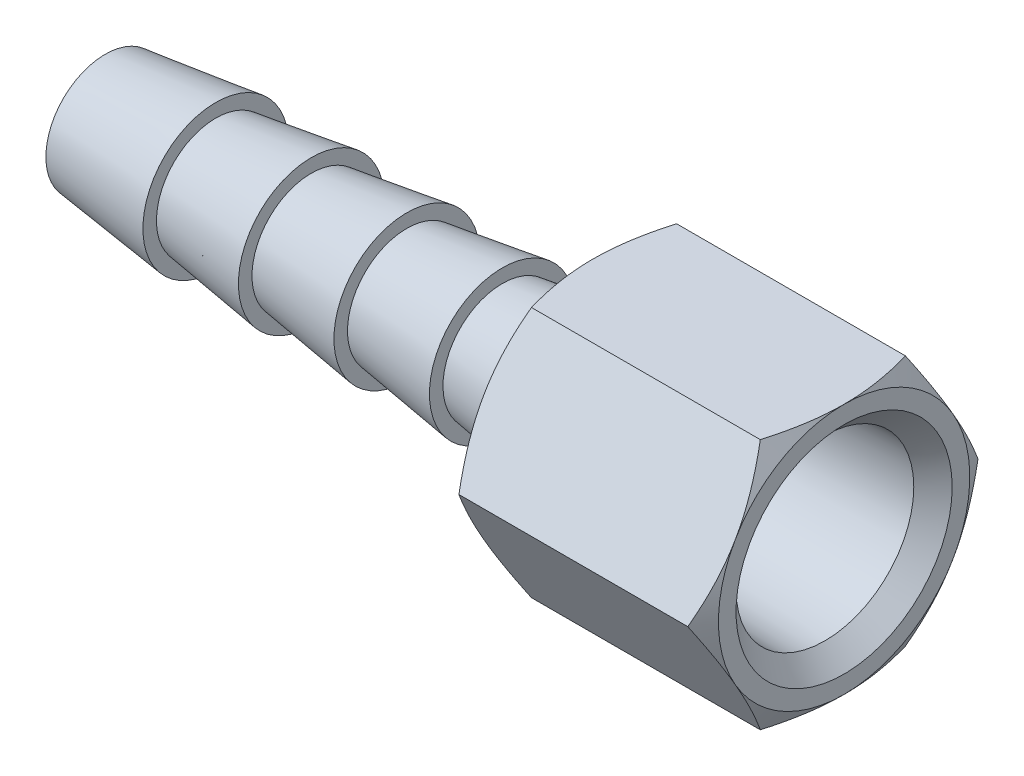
ISO-10303-21;
HEADER;
FILE_DESCRIPTION(('STEP AP214'),'2;1');
FILE_NAME('part.step','',(''),(''),'','','');
FILE_SCHEMA(('AUTOMOTIVE_DESIGN { 1 0 10303 214 1 1 1 1 }'));
ENDSEC;
DATA;
#1=APPLICATION_CONTEXT('core data for automotive mechanical design processes');
#2=APPLICATION_PROTOCOL_DEFINITION('international standard','automotive_design',2000,#1);
#3=PRODUCT_CONTEXT('',#1,'mechanical');
#4=PRODUCT('Part','Part','',(#3));
#5=PRODUCT_RELATED_PRODUCT_CATEGORY('part','',(#4));
#6=PRODUCT_DEFINITION_FORMATION('','',#4);
#7=PRODUCT_DEFINITION_CONTEXT('part definition',#1,'design');
#8=PRODUCT_DEFINITION('design','',#6,#7);
#9=PRODUCT_DEFINITION_SHAPE('','',#8);
#10=(LENGTH_UNIT() NAMED_UNIT(*) SI_UNIT(.MILLI.,.METRE.));
#11=(NAMED_UNIT(*) PLANE_ANGLE_UNIT() SI_UNIT($,.RADIAN.));
#12=(NAMED_UNIT(*) SI_UNIT($,.STERADIAN.) SOLID_ANGLE_UNIT());
#13=UNCERTAINTY_MEASURE_WITH_UNIT(LENGTH_MEASURE(1.E-05),#10,'distance_accuracy_value','');
#14=(GEOMETRIC_REPRESENTATION_CONTEXT(3) GLOBAL_UNCERTAINTY_ASSIGNED_CONTEXT((#13)) GLOBAL_UNIT_ASSIGNED_CONTEXT((#10,
#11,#12)) REPRESENTATION_CONTEXT('',''));
#15=CARTESIAN_POINT('',(0.,0.,0.));
#16=DIRECTION('',(0.,0.,1.));
#17=DIRECTION('',(1.,0.,0.));
#18=AXIS2_PLACEMENT_3D('',#15,#16,#17);
#19=CARTESIAN_POINT('',(24.6379999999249,0.,0.));
#20=DIRECTION('',(1.,0.,0.));
#21=DIRECTION('',(0.,1.,0.));
#22=AXIS2_PLACEMENT_3D('',#19,#20,#21);
#23=CONICAL_SURFACE('',#22,3.68299999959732,0.148889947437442);
#24=CARTESIAN_POINT('',(24.6380000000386,0.,0.));
#25=DIRECTION('',(1.,0.,0.));
#26=DIRECTION('',(0.,1.,0.));
#27=AXIS2_PLACEMENT_3D('',#24,#25,#26);
#28=CIRCLE('',#27,3.68299999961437);
#29=CARTESIAN_POINT('',(24.6380000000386,3.68299999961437,0.));
#30=VERTEX_POINT('',#29);
#31=EDGE_CURVE('E466',#30,#30,#28,.F.);
#32=ORIENTED_EDGE('',*,*,#31,.T.);
#33=EDGE_LOOP('',(#32));
#34=FACE_BOUND('',#33,.T.);
#35=CARTESIAN_POINT('',(20.0659999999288,0.,0.));
#36=DIRECTION('',(1.,0.,0.));
#37=DIRECTION('',(0.,1.,0.));
#38=AXIS2_PLACEMENT_3D('',#35,#36,#37);
#39=CIRCLE('',#38,2.99720000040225);
#40=CARTESIAN_POINT('',(20.0659999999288,2.99720000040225,0.));
#41=VERTEX_POINT('',#40);
#42=EDGE_CURVE('E20',#41,#41,#39,.F.);
#43=ORIENTED_EDGE('',*,*,#42,.F.);
#44=EDGE_LOOP('',(#43));
#45=FACE_BOUND('',#44,.T.);
#46=ADVANCED_FACE('F16',(#34,#45),#23,.T.);
#47=CARTESIAN_POINT('',(20.066,0.,1.8415));
#48=DIRECTION('',(1.,0.,0.));
#49=DIRECTION('',(0.,0.,-1.));
#50=AXIS2_PLACEMENT_3D('',#47,#48,#49);
#51=PLANE('',#50);
#52=ORIENTED_EDGE('',*,*,#42,.T.);
#53=EDGE_LOOP('',(#52));
#54=FACE_BOUND('',#53,.T.);
#55=CARTESIAN_POINT('',(20.0660000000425,0.,0.));
#56=DIRECTION('',(1.,0.,0.));
#57=DIRECTION('',(0.,0.,-1.));
#58=AXIS2_PLACEMENT_3D('',#55,#56,#57);
#59=CIRCLE('',#58,3.68299999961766);
#60=CARTESIAN_POINT('',(20.0660000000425,0.,-3.68299999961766));
#61=VERTEX_POINT('',#60);
#62=EDGE_CURVE('E133',#61,#61,#59,.F.);
#63=ORIENTED_EDGE('',*,*,#62,.F.);
#64=EDGE_LOOP('',(#63));
#65=FACE_BOUND('',#64,.T.);
#66=ADVANCED_FACE('F172',(#54,#65),#51,.T.);
#67=CARTESIAN_POINT('',(24.638,0.,0.));
#68=DIRECTION('',(1.,0.,0.));
#69=DIRECTION('',(0.,0.,-1.));
#70=AXIS2_PLACEMENT_3D('',#67,#68,#69);
#71=PLANE('',#70);
#72=ORIENTED_EDGE('',*,*,#31,.F.);
#73=EDGE_LOOP('',(#72));
#74=FACE_BOUND('',#73,.T.);
#75=CARTESIAN_POINT('',(24.6379999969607,0.,0.));
#76=DIRECTION('',(1.,0.,0.));
#77=DIRECTION('',(0.,0.,-1.));
#78=AXIS2_PLACEMENT_3D('',#75,#76,#77);
#79=CIRCLE('',#78,6.35000000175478);
#80=CARTESIAN_POINT('',(24.6379999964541,3.17500000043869,5.49926131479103));
#81=VERTEX_POINT('',#80);
#82=CARTESIAN_POINT('',(24.6379999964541,-3.1750000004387,5.49926131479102));
#83=VERTEX_POINT('',#82);
#84=EDGE_CURVE('E125',#81,#83,#79,.T.);
#85=ORIENTED_EDGE('',*,*,#84,.F.);
#86=CARTESIAN_POINT('',(24.6379999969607,0.,0.));
#87=DIRECTION('',(1.,0.,0.));
#88=DIRECTION('',(0.,0.,-1.));
#89=AXIS2_PLACEMENT_3D('',#86,#87,#88);
#90=CIRCLE('',#89,6.35000000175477);
#91=CARTESIAN_POINT('',(24.6379999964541,6.35000000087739,0.));
#92=VERTEX_POINT('',#91);
#93=EDGE_CURVE('E103',#92,#81,#90,.T.);
#94=ORIENTED_EDGE('',*,*,#93,.F.);
#95=CARTESIAN_POINT('',(24.6379999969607,0.,0.));
#96=DIRECTION('',(1.,0.,0.));
#97=DIRECTION('',(0.,0.,-1.));
#98=AXIS2_PLACEMENT_3D('',#95,#96,#97);
#99=CIRCLE('',#98,6.35000000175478);
#100=CARTESIAN_POINT('',(24.6379999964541,3.17500000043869,-5.49926131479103));
#101=VERTEX_POINT('',#100);
#102=EDGE_CURVE('E113',#101,#92,#99,.T.);
#103=ORIENTED_EDGE('',*,*,#102,.F.);
#104=CARTESIAN_POINT('',(24.6379999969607,0.,0.));
#105=DIRECTION('',(1.,0.,0.));
#106=DIRECTION('',(0.,0.,-1.));
#107=AXIS2_PLACEMENT_3D('',#104,#105,#106);
#108=CIRCLE('',#107,6.35000000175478);
#109=CARTESIAN_POINT('',(24.6379999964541,-3.17500000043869,-5.49926131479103));
#110=VERTEX_POINT('',#109);
#111=EDGE_CURVE('E461',#110,#101,#108,.T.);
#112=ORIENTED_EDGE('',*,*,#111,.F.);
#113=CARTESIAN_POINT('',(24.6379999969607,0.,0.));
#114=DIRECTION('',(1.,0.,0.));
#115=DIRECTION('',(0.,0.,-1.));
#116=AXIS2_PLACEMENT_3D('',#113,#114,#115);
#117=CIRCLE('',#116,6.35000000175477);
#118=CARTESIAN_POINT('',(24.6379999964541,-6.35000000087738,0.));
#119=VERTEX_POINT('',#118);
#120=EDGE_CURVE('E440',#119,#110,#117,.T.);
#121=ORIENTED_EDGE('',*,*,#120,.F.);
#122=CARTESIAN_POINT('',(24.6379999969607,0.,0.));
#123=DIRECTION('',(1.,0.,0.));
#124=DIRECTION('',(0.,0.,-1.));
#125=AXIS2_PLACEMENT_3D('',#122,#123,#124);
#126=CIRCLE('',#125,6.35000000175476);
#127=EDGE_CURVE('E128',#83,#119,#126,.T.);
#128=ORIENTED_EDGE('',*,*,#127,.F.);
#129=EDGE_LOOP('',(#85,#94,#103,#112,#121,#128));
#130=FACE_BOUND('',#129,.T.);
#131=ADVANCED_FACE('F126',(#74,#130),#71,.F.);
#132=CARTESIAN_POINT('',(20.0660000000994,0.,0.));
#133=DIRECTION('',(1.,0.,0.));
#134=DIRECTION('',(0.,0.,-1.));
#135=AXIS2_PLACEMENT_3D('',#132,#133,#134);
#136=CONICAL_SURFACE('',#135,3.68299999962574,0.141160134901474);
#137=CARTESIAN_POINT('',(15.2399999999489,0.,0.));
#138=DIRECTION('',(1.,0.,0.));
#139=DIRECTION('',(0.,0.,-1.));
#140=AXIS2_PLACEMENT_3D('',#137,#138,#139);
#141=CIRCLE('',#140,2.99720000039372);
#142=CARTESIAN_POINT('',(15.2399999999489,0.,-2.99720000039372));
#143=VERTEX_POINT('',#142);
#144=EDGE_CURVE('E112',#143,#143,#141,.F.);
#145=ORIENTED_EDGE('',*,*,#144,.F.);
#146=EDGE_LOOP('',(#145));
#147=FACE_BOUND('',#146,.T.);
#148=ORIENTED_EDGE('',*,*,#62,.T.);
#149=EDGE_LOOP('',(#148));
#150=FACE_BOUND('',#149,.T.);
#151=ADVANCED_FACE('F163',(#147,#150),#136,.T.);
#152=CARTESIAN_POINT('',(25.2085620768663,0.,0.));
#153=DIRECTION('',(1.,0.,0.));
#154=DIRECTION('',(0.,0.,-1.));
#155=AXIS2_PLACEMENT_3D('',#152,#153,#154);
#156=CONICAL_SURFACE('',#155,7.33824251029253,1.04719755);
#157=ORIENTED_EDGE('',*,*,#84,.T.);
#158=CARTESIAN_POINT('',(25.2051591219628,7.33747232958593E-10,7.33234841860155));
#159=CARTESIAN_POINT('',(25.1189896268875,-0.258443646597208,7.18313590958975));
#160=CARTESIAN_POINT('',(25.0400433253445,-0.518957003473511,7.03272845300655));
#161=CARTESIAN_POINT('',(24.9008229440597,-1.0422801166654,6.73058771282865));
#162=CARTESIAN_POINT('',(24.8404565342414,-1.30507161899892,6.5788649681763));
#163=CARTESIAN_POINT('',(24.7663368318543,-1.70173898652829,6.34984895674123));
#164=CARTESIAN_POINT('',(24.744359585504,-1.83446251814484,6.27322099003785));
#165=CARTESIAN_POINT('',(24.7063165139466,-2.10054498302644,6.1195982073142));
#166=CARTESIAN_POINT('',(24.6902505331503,-2.23390389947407,6.04260340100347));
#167=CARTESIAN_POINT('',(24.6643122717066,-2.50175041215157,5.88796214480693));
#168=CARTESIAN_POINT('',(24.6544714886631,-2.636240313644,5.81031436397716));
#169=CARTESIAN_POINT('',(24.6413017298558,-2.90548461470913,5.65486609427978));
#170=CARTESIAN_POINT('',(24.6379740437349,-3.04023906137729,5.57706557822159));
#171=CARTESIAN_POINT('',(24.6379999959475,-3.17499999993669,5.49926131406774));
#172=B_SPLINE_CURVE_WITH_KNOTS('',3,(#158,#159,#160,#161,#162,#163,#164,#165,#166,#167,#168,
#169,#170,#171),.UNSPECIFIED.,.F.,.F.,(4,2,2,2,2,2,4),(0.,0.932226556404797,1.85974282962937,
2.32410951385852,2.78846397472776,3.25514952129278,3.72192746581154),.UNSPECIFIED.);
#173=CARTESIAN_POINT('',(25.2051591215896,-2.86750911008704E-10,7.3323484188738));
#174=VERTEX_POINT('',#173);
#175=EDGE_CURVE('E136',#174,#83,#172,.T.);
#176=ORIENTED_EDGE('',*,*,#175,.F.);
#177=CARTESIAN_POINT('',(24.6379999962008,3.17499999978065,5.49926131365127));
#178=CARTESIAN_POINT('',(24.637974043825,3.04023906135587,5.57706557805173));
#179=CARTESIAN_POINT('',(24.6413017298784,2.90548461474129,5.65486609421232));
#180=CARTESIAN_POINT('',(24.6544714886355,2.63624031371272,5.81031436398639));
#181=CARTESIAN_POINT('',(24.6643122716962,2.50175041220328,5.88796214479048));
#182=CARTESIAN_POINT('',(24.6902505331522,2.23390389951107,6.04260340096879));
#183=CARTESIAN_POINT('',(24.7063165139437,2.10054498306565,6.11959820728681));
#184=CARTESIAN_POINT('',(24.7443595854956,1.83446251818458,6.27322099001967));
#185=CARTESIAN_POINT('',(24.766336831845,1.70173898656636,6.34984895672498));
#186=CARTESIAN_POINT('',(24.840456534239,1.30507161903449,6.57886496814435));
#187=CARTESIAN_POINT('',(24.9008229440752,1.0422801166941,6.73058771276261));
#188=CARTESIAN_POINT('',(25.0400433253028,0.518957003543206,7.03272845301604));
#189=CARTESIAN_POINT('',(25.1189896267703,0.258443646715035,7.18313590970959));
#190=CARTESIAN_POINT('',(25.2051591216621,-5.04110904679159E-10,7.3323484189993));
#191=B_SPLINE_CURVE_WITH_KNOTS('',3,(#177,#178,#179,#180,#181,#182,#183,#184,#185,#186,#187,
#188,#189,#190),.UNSPECIFIED.,.F.,.F.,(4,2,2,2,2,2,4),(0.,0.466777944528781,0.933463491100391,
1.39781795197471,1.86218463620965,2.78970090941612,3.7219274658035),.UNSPECIFIED.);
#192=EDGE_CURVE('E118',#81,#174,#191,.T.);
#193=ORIENTED_EDGE('',*,*,#192,.F.);
#194=EDGE_LOOP('',(#157,#176,#193));
#195=FACE_BOUND('',#194,.T.);
#196=ADVANCED_FACE('F135',(#195),#156,.T.);
#197=CARTESIAN_POINT('',(25.2085620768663,0.,0.));
#198=DIRECTION('',(1.,0.,0.));
#199=DIRECTION('',(0.,0.,-1.));
#200=AXIS2_PLACEMENT_3D('',#197,#198,#199);
#201=CONICAL_SURFACE('',#200,7.33824251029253,1.04719755);
#202=ORIENTED_EDGE('',*,*,#127,.T.);
#203=CARTESIAN_POINT('',(25.2051591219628,-6.34999999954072,3.66617420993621));
#204=CARTESIAN_POINT('',(25.1189896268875,-6.34999999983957,3.367749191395));
#205=CARTESIAN_POINT('',(25.0400433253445,-6.34999999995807,3.06693427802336));
#206=CARTESIAN_POINT('',(24.9008229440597,-6.35000000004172,2.46265279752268));
#207=CARTESIAN_POINT('',(24.8404565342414,-6.35000000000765,2.15920730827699));
#208=CARTESIAN_POINT('',(24.7663368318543,-6.34999999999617,1.70117528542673));
#209=CARTESIAN_POINT('',(24.744359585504,-6.34999999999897,1.54791935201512));
#210=CARTESIAN_POINT('',(24.7063165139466,-6.35000000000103,1.24067378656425));
#211=CARTESIAN_POINT('',(24.6902505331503,-6.35000000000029,1.08668417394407));
#212=CARTESIAN_POINT('',(24.6643122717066,-6.3499999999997,0.777401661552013));
#213=CARTESIAN_POINT('',(24.6544714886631,-6.34999999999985,0.62210609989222));
#214=CARTESIAN_POINT('',(24.6413017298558,-6.35000000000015,0.311209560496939));
#215=CARTESIAN_POINT('',(24.6379740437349,-6.3500000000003,0.1556085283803));
#216=CARTESIAN_POINT('',(24.6379999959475,-6.35,7.31096608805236E-11));
#217=B_SPLINE_CURVE_WITH_KNOTS('',3,(#203,#204,#205,#206,#207,#208,#209,#210,#211,#212,#213,
#214,#215,#216),.UNSPECIFIED.,.F.,.F.,(4,2,2,2,2,2,4),(0.,0.932226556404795,1.85974282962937,
2.32410951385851,2.78846397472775,3.25514952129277,3.72192746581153),.UNSPECIFIED.);
#218=CARTESIAN_POINT('',(25.2051591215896,-6.35000000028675,3.66617420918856));
#219=VERTEX_POINT('',#218);
#220=EDGE_CURVE('E236',#219,#119,#217,.T.);
#221=ORIENTED_EDGE('',*,*,#220,.F.);
#222=CARTESIAN_POINT('',(24.6379999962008,-3.17499999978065,5.49926131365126));
#223=CARTESIAN_POINT('',(24.637974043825,-3.30976093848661,5.4214570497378));
#224=CARTESIAN_POINT('',(24.6413017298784,-3.44451538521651,5.34365653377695));
#225=CARTESIAN_POINT('',(24.6544714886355,-3.71375968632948,5.18820826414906));
#226=CARTESIAN_POINT('',(24.6643122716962,-3.84824958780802,5.11056048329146));
#227=CARTESIAN_POINT('',(24.6902505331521,-4.11609610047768,4.9559192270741));
#228=CARTESIAN_POINT('',(24.7063165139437,-4.24945501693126,4.8789244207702));
#229=CARTESIAN_POINT('',(24.7443595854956,-4.51553748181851,4.72530163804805));
#230=CARTESIAN_POINT('',(24.766336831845,-4.64826101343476,4.64867367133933));
#231=CARTESIAN_POINT('',(24.840456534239,-5.04492838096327,4.41965765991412));
#232=CARTESIAN_POINT('',(24.9008229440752,-5.30771988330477,4.2679349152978));
#233=CARTESIAN_POINT('',(25.0400433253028,-5.83104299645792,3.96579417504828));
#234=CARTESIAN_POINT('',(25.1189896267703,-6.09155635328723,3.8153867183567));
#235=CARTESIAN_POINT('',(25.2051591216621,-6.35000000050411,3.66617420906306));
#236=B_SPLINE_CURVE_WITH_KNOTS('',3,(#222,#223,#224,#225,#226,#227,#228,#229,#230,#231,#232,
#233,#234,#235),.UNSPECIFIED.,.F.,.F.,(4,2,2,2,2,2,4),(0.,0.466777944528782,0.933463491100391,
1.39781795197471,1.86218463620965,2.78970090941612,3.7219274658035),.UNSPECIFIED.);
#237=EDGE_CURVE('E237',#83,#219,#236,.T.);
#238=ORIENTED_EDGE('',*,*,#237,.F.);
#239=EDGE_LOOP('',(#202,#221,#238));
#240=FACE_BOUND('',#239,.T.);
#241=ADVANCED_FACE('F162',(#240),#201,.T.);
#242=CARTESIAN_POINT('',(25.2085620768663,0.,0.));
#243=DIRECTION('',(1.,0.,0.));
#244=DIRECTION('',(0.,0.,-1.));
#245=AXIS2_PLACEMENT_3D('',#242,#243,#244);
#246=CONICAL_SURFACE('',#245,7.33824251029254,1.04719755);
#247=CARTESIAN_POINT('',(24.6379999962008,-6.34999999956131,0.));
#248=CARTESIAN_POINT('',(24.637974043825,-6.34999999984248,-0.155608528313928));
#249=CARTESIAN_POINT('',(24.6413017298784,-6.3499999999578,-0.311209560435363));
#250=CARTESIAN_POINT('',(24.6544714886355,-6.35000000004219,-0.622106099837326));
#251=CARTESIAN_POINT('',(24.6643122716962,-6.3500000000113,-0.777401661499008));
#252=CARTESIAN_POINT('',(24.6902505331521,-6.34999999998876,-1.08668417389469));
#253=CARTESIAN_POINT('',(24.7063165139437,-6.34999999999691,-1.2406737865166));
#254=CARTESIAN_POINT('',(24.7443595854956,-6.35000000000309,-1.54791935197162));
#255=CARTESIAN_POINT('',(24.766336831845,-6.35000000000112,-1.70117528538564));
#256=CARTESIAN_POINT('',(24.840456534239,-6.34999999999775,-2.15920730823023));
#257=CARTESIAN_POINT('',(24.9008229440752,-6.34999999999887,-2.46265279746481));
#258=CARTESIAN_POINT('',(25.0400433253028,-6.35000000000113,-3.06693427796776));
#259=CARTESIAN_POINT('',(25.1189896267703,-6.35000000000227,-3.36774919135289));
#260=CARTESIAN_POINT('',(25.2051591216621,-6.35,-3.66617420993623));
#261=B_SPLINE_CURVE_WITH_KNOTS('',3,(#247,#248,#249,#250,#251,#252,#253,#254,#255,#256,#257,
#258,#259,#260),.UNSPECIFIED.,.F.,.F.,(4,2,2,2,2,2,4),(0.,0.466777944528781,0.933463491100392,
1.39781795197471,1.86218463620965,2.78970090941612,3.7219274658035),.UNSPECIFIED.);
#262=CARTESIAN_POINT('',(25.2051591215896,-6.35,-3.66617420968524));
#263=VERTEX_POINT('',#262);
#264=EDGE_CURVE('E233',#119,#263,#261,.T.);
#265=ORIENTED_EDGE('',*,*,#264,.F.);
#266=ORIENTED_EDGE('',*,*,#120,.T.);
#267=CARTESIAN_POINT('',(25.2051591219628,-6.35000000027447,-3.66617420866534));
#268=CARTESIAN_POINT('',(25.1189896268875,-6.09155635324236,-3.81538671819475));
#269=CARTESIAN_POINT('',(25.0400433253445,-5.83104299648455,-3.96579417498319));
#270=CARTESIAN_POINT('',(24.9008229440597,-5.30771988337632,-4.26793491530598));
#271=CARTESIAN_POINT('',(24.8404565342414,-5.04492838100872,-4.41965765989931));
#272=CARTESIAN_POINT('',(24.7663368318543,-4.64826101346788,-4.6486736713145));
#273=CARTESIAN_POINT('',(24.744359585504,-4.51553748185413,-4.72530163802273));
#274=CARTESIAN_POINT('',(24.7063165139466,-4.24945501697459,-4.87892442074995));
#275=CARTESIAN_POINT('',(24.6902505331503,-4.11609610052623,-4.95591922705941));
#276=CARTESIAN_POINT('',(24.6643122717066,-3.84824958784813,-5.11056048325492));
#277=CARTESIAN_POINT('',(24.6544714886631,-3.71375968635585,-5.18820826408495));
#278=CARTESIAN_POINT('',(24.6413017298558,-3.44451538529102,-5.34365653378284));
#279=CARTESIAN_POINT('',(24.6379740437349,-3.309760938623,-5.42145704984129));
#280=CARTESIAN_POINT('',(24.6379999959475,-3.17500000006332,-5.49926131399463));
#281=B_SPLINE_CURVE_WITH_KNOTS('',3,(#267,#268,#269,#270,#271,#272,#273,#274,#275,#276,#277,
#278,#279,#280),.UNSPECIFIED.,.F.,.F.,(4,2,2,2,2,2,4),(0.,0.932226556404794,1.85974282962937,
2.32410951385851,2.78846397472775,3.25514952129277,3.72192746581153),.UNSPECIFIED.);
#282=EDGE_CURVE('E232',#263,#110,#281,.T.);
#283=ORIENTED_EDGE('',*,*,#282,.F.);
#284=EDGE_LOOP('',(#265,#266,#283));
#285=FACE_BOUND('',#284,.T.);
#286=ADVANCED_FACE('F426',(#285),#246,.T.);
#287=CARTESIAN_POINT('',(25.2085620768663,0.,0.));
#288=DIRECTION('',(1.,0.,0.));
#289=DIRECTION('',(0.,0.,-1.));
#290=AXIS2_PLACEMENT_3D('',#287,#288,#289);
#291=CONICAL_SURFACE('',#290,7.33824251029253,1.04719755);
#292=CARTESIAN_POINT('',(24.6379999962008,-3.17499999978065,-5.49926131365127));
#293=CARTESIAN_POINT('',(24.637974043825,-3.04023906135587,-5.57706557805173));
#294=CARTESIAN_POINT('',(24.6413017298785,-2.90548461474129,-5.65486609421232));
#295=CARTESIAN_POINT('',(24.6544714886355,-2.63624031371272,-5.81031436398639));
#296=CARTESIAN_POINT('',(24.6643122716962,-2.50175041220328,-5.88796214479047));
#297=CARTESIAN_POINT('',(24.6902505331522,-2.23390389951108,-6.04260340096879));
#298=CARTESIAN_POINT('',(24.7063165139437,-2.10054498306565,-6.11959820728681));
#299=CARTESIAN_POINT('',(24.7443595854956,-1.83446251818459,-6.27322099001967));
#300=CARTESIAN_POINT('',(24.766336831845,-1.70173898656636,-6.34984895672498));
#301=CARTESIAN_POINT('',(24.840456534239,-1.30507161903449,-6.57886496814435));
#302=CARTESIAN_POINT('',(24.9008229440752,-1.04228011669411,-6.73058771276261));
#303=CARTESIAN_POINT('',(25.0400433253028,-0.518957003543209,-7.03272845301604));
#304=CARTESIAN_POINT('',(25.1189896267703,-0.258443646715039,-7.18313590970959));
#305=CARTESIAN_POINT('',(25.2051591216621,5.04107462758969E-10,-7.3323484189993));
#306=B_SPLINE_CURVE_WITH_KNOTS('',3,(#292,#293,#294,#295,#296,#297,#298,#299,#300,#301,#302,
#303,#304,#305),.UNSPECIFIED.,.F.,.F.,(4,2,2,2,2,2,4),(0.,0.46677794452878,0.933463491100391,
1.39781795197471,1.86218463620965,2.78970090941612,3.7219274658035),.UNSPECIFIED.);
#307=CARTESIAN_POINT('',(25.2051591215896,2.8674952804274E-10,-7.3323484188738));
#308=VERTEX_POINT('',#307);
#309=EDGE_CURVE('E228',#110,#308,#306,.T.);
#310=ORIENTED_EDGE('',*,*,#309,.F.);
#311=ORIENTED_EDGE('',*,*,#111,.T.);
#312=CARTESIAN_POINT('',(25.2051591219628,-7.33746896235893E-10,-7.33234841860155));
#313=CARTESIAN_POINT('',(25.1189896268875,0.258443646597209,-7.18313590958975));
#314=CARTESIAN_POINT('',(25.0400433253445,0.518957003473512,-7.03272845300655));
#315=CARTESIAN_POINT('',(24.9008229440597,1.0422801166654,-6.73058771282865));
#316=CARTESIAN_POINT('',(24.8404565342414,1.30507161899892,-6.5788649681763));
#317=CARTESIAN_POINT('',(24.7663368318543,1.70173898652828,-6.34984895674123));
#318=CARTESIAN_POINT('',(24.744359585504,1.83446251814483,-6.27322099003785));
#319=CARTESIAN_POINT('',(24.7063165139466,2.10054498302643,-6.1195982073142));
#320=CARTESIAN_POINT('',(24.6902505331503,2.23390389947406,-6.04260340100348));
#321=CARTESIAN_POINT('',(24.6643122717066,2.50175041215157,-5.88796214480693));
#322=CARTESIAN_POINT('',(24.6544714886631,2.63624031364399,-5.81031436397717));
#323=CARTESIAN_POINT('',(24.6413017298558,2.90548461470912,-5.65486609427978));
#324=CARTESIAN_POINT('',(24.6379740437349,3.04023906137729,-5.57706557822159));
#325=CARTESIAN_POINT('',(24.6379999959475,3.17499999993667,-5.49926131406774));
#326=B_SPLINE_CURVE_WITH_KNOTS('',3,(#312,#313,#314,#315,#316,#317,#318,#319,#320,#321,#322,
#323,#324,#325),.UNSPECIFIED.,.F.,.F.,(4,2,2,2,2,2,4),(0.,0.932226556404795,1.85974282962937,
2.32410951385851,2.78846397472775,3.25514952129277,3.72192746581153),.UNSPECIFIED.);
#327=EDGE_CURVE('E227',#308,#101,#326,.T.);
#328=ORIENTED_EDGE('',*,*,#327,.F.);
#329=EDGE_LOOP('',(#310,#311,#328));
#330=FACE_BOUND('',#329,.T.);
#331=ADVANCED_FACE('F325',(#330),#291,.T.);
#332=CARTESIAN_POINT('',(25.2085620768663,0.,0.));
#333=DIRECTION('',(1.,0.,0.));
#334=DIRECTION('',(0.,0.,-1.));
#335=AXIS2_PLACEMENT_3D('',#332,#333,#334);
#336=CONICAL_SURFACE('',#335,7.33824251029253,1.04719755);
#337=CARTESIAN_POINT('',(24.6379999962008,3.17499999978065,-5.49926131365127));
#338=CARTESIAN_POINT('',(24.637974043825,3.3097609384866,-5.42145704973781));
#339=CARTESIAN_POINT('',(24.6413017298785,3.4445153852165,-5.34365653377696));
#340=CARTESIAN_POINT('',(24.6544714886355,3.71375968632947,-5.18820826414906));
#341=CARTESIAN_POINT('',(24.6643122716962,3.84824958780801,-5.11056048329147));
#342=CARTESIAN_POINT('',(24.6902505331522,4.11609610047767,-4.9559192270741));
#343=CARTESIAN_POINT('',(24.7063165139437,4.24945501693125,-4.8789244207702));
#344=CARTESIAN_POINT('',(24.7443595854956,4.5155374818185,-4.72530163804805));
#345=CARTESIAN_POINT('',(24.766336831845,4.64826101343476,-4.64867367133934));
#346=CARTESIAN_POINT('',(24.840456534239,5.04492838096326,-4.41965765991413));
#347=CARTESIAN_POINT('',(24.9008229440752,5.30771988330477,-4.2679349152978));
#348=CARTESIAN_POINT('',(25.0400433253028,5.83104299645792,-3.96579417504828));
#349=CARTESIAN_POINT('',(25.1189896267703,6.09155635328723,-3.8153867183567));
#350=CARTESIAN_POINT('',(25.2051591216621,6.35000000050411,-3.66617420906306));
#351=B_SPLINE_CURVE_WITH_KNOTS('',3,(#337,#338,#339,#340,#341,#342,#343,#344,#345,#346,#347,
#348,#349,#350),.UNSPECIFIED.,.F.,.F.,(4,2,2,2,2,2,4),(0.,0.466777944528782,0.933463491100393,
1.39781795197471,1.86218463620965,2.78970090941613,3.72192746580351),.UNSPECIFIED.);
#352=CARTESIAN_POINT('',(25.2051591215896,6.35000000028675,-3.66617420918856));
#353=VERTEX_POINT('',#352);
#354=EDGE_CURVE('E223',#101,#353,#351,.T.);
#355=ORIENTED_EDGE('',*,*,#354,.F.);
#356=ORIENTED_EDGE('',*,*,#102,.T.);
#357=CARTESIAN_POINT('',(25.2051591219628,6.34999999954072,-3.66617420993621));
#358=CARTESIAN_POINT('',(25.1189896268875,6.34999999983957,-3.367749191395));
#359=CARTESIAN_POINT('',(25.0400433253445,6.34999999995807,-3.06693427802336));
#360=CARTESIAN_POINT('',(24.9008229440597,6.35000000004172,-2.46265279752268));
#361=CARTESIAN_POINT('',(24.8404565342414,6.35000000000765,-2.159207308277));
#362=CARTESIAN_POINT('',(24.7663368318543,6.34999999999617,-1.70117528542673));
#363=CARTESIAN_POINT('',(24.744359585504,6.34999999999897,-1.54791935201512));
#364=CARTESIAN_POINT('',(24.7063165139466,6.35000000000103,-1.24067378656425));
#365=CARTESIAN_POINT('',(24.6902505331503,6.35000000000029,-1.08668417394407));
#366=CARTESIAN_POINT('',(24.6643122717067,6.3499999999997,-0.777401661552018));
#367=CARTESIAN_POINT('',(24.6544714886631,6.34999999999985,-0.622106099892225));
#368=CARTESIAN_POINT('',(24.6413017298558,6.35000000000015,-0.311209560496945));
#369=CARTESIAN_POINT('',(24.6379740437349,6.3500000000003,-0.155608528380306));
#370=CARTESIAN_POINT('',(24.6379999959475,6.35,-7.31163825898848E-11));
#371=B_SPLINE_CURVE_WITH_KNOTS('',3,(#357,#358,#359,#360,#361,#362,#363,#364,#365,#366,#367,
#368,#369,#370),.UNSPECIFIED.,.F.,.F.,(4,2,2,2,2,2,4),(0.,0.932226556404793,1.85974282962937,
2.32410951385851,2.78846397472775,3.25514952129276,3.72192746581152),.UNSPECIFIED.);
#372=EDGE_CURVE('E222',#353,#92,#371,.T.);
#373=ORIENTED_EDGE('',*,*,#372,.F.);
#374=EDGE_LOOP('',(#355,#356,#373));
#375=FACE_BOUND('',#374,.T.);
#376=ADVANCED_FACE('F320',(#375),#336,.T.);
#377=CARTESIAN_POINT('',(25.2085620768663,0.,0.));
#378=DIRECTION('',(1.,0.,0.));
#379=DIRECTION('',(0.,0.,-1.));
#380=AXIS2_PLACEMENT_3D('',#377,#378,#379);
#381=CONICAL_SURFACE('',#380,7.33824251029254,1.04719755);
#382=ORIENTED_EDGE('',*,*,#93,.T.);
#383=CARTESIAN_POINT('',(25.2051591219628,6.35000000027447,3.66617420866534));
#384=CARTESIAN_POINT('',(25.1189896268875,6.09155635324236,3.81538671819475));
#385=CARTESIAN_POINT('',(25.0400433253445,5.83104299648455,3.96579417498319));
#386=CARTESIAN_POINT('',(24.9008229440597,5.30771988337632,4.26793491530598));
#387=CARTESIAN_POINT('',(24.8404565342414,5.04492838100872,4.41965765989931));
#388=CARTESIAN_POINT('',(24.7663368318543,4.64826101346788,4.64867367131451));
#389=CARTESIAN_POINT('',(24.744359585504,4.51553748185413,4.72530163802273));
#390=CARTESIAN_POINT('',(24.7063165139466,4.24945501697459,4.87892442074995));
#391=CARTESIAN_POINT('',(24.6902505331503,4.11609610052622,4.95591922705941));
#392=CARTESIAN_POINT('',(24.6643122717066,3.84824958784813,5.11056048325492));
#393=CARTESIAN_POINT('',(24.6544714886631,3.71375968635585,5.18820826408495));
#394=CARTESIAN_POINT('',(24.6413017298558,3.44451538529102,5.34365653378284));
#395=CARTESIAN_POINT('',(24.6379740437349,3.309760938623,5.42145704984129));
#396=CARTESIAN_POINT('',(24.6379999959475,3.17500000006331,5.49926131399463));
#397=B_SPLINE_CURVE_WITH_KNOTS('',3,(#383,#384,#385,#386,#387,#388,#389,#390,#391,#392,#393,
#394,#395,#396),.UNSPECIFIED.,.F.,.F.,(4,2,2,2,2,2,4),(0.,0.932226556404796,1.85974282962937,
2.32410951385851,2.78846397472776,3.25514952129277,3.72192746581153),.UNSPECIFIED.);
#398=CARTESIAN_POINT('',(25.2051591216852,6.35000000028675,3.66617420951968));
#399=VERTEX_POINT('',#398);
#400=EDGE_CURVE('E106',#399,#81,#397,.T.);
#401=ORIENTED_EDGE('',*,*,#400,.F.);
#402=CARTESIAN_POINT('',(24.6379999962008,6.34999999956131,0.));
#403=CARTESIAN_POINT('',(24.637974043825,6.34999999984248,0.155608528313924));
#404=CARTESIAN_POINT('',(24.6413017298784,6.3499999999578,0.311209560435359));
#405=CARTESIAN_POINT('',(24.6544714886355,6.35000000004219,0.622106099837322));
#406=CARTESIAN_POINT('',(24.6643122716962,6.3500000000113,0.777401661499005));
#407=CARTESIAN_POINT('',(24.6902505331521,6.34999999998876,1.08668417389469));
#408=CARTESIAN_POINT('',(24.7063165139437,6.34999999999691,1.2406737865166));
#409=CARTESIAN_POINT('',(24.7443595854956,6.35000000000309,1.54791935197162));
#410=CARTESIAN_POINT('',(24.766336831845,6.35000000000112,1.70117528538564));
#411=CARTESIAN_POINT('',(24.840456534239,6.34999999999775,2.15920730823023));
#412=CARTESIAN_POINT('',(24.9008229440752,6.34999999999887,2.46265279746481));
#413=CARTESIAN_POINT('',(25.0400433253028,6.35000000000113,3.06693427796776));
#414=CARTESIAN_POINT('',(25.1189896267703,6.35000000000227,3.36774919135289));
#415=CARTESIAN_POINT('',(25.2051591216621,6.35,3.66617420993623));
#416=B_SPLINE_CURVE_WITH_KNOTS('',3,(#402,#403,#404,#405,#406,#407,#408,#409,#410,#411,#412,
#413,#414,#415),.UNSPECIFIED.,.F.,.F.,(4,2,2,2,2,2,4),(0.,0.466777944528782,0.933463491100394,
1.39781795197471,1.86218463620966,2.78970090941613,3.72192746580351),.UNSPECIFIED.);
#417=EDGE_CURVE('E108',#92,#399,#416,.T.);
#418=ORIENTED_EDGE('',*,*,#417,.F.);
#419=EDGE_LOOP('',(#382,#401,#418));
#420=FACE_BOUND('',#419,.T.);
#421=ADVANCED_FACE('F105',(#420),#381,.T.);
#422=CARTESIAN_POINT('',(15.24,0.,1.8415));
#423=DIRECTION('',(1.,0.,0.));
#424=DIRECTION('',(0.,0.,-1.));
#425=AXIS2_PLACEMENT_3D('',#422,#423,#424);
#426=PLANE('',#425);
#427=ORIENTED_EDGE('',*,*,#144,.T.);
#428=EDGE_LOOP('',(#427));
#429=FACE_BOUND('',#428,.T.);
#430=CARTESIAN_POINT('',(15.2400000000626,0.,0.));
#431=DIRECTION('',(1.,0.,0.));
#432=DIRECTION('',(0.,0.,-1.));
#433=AXIS2_PLACEMENT_3D('',#430,#431,#432);
#434=CIRCLE('',#433,3.68299999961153);
#435=CARTESIAN_POINT('',(15.2400000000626,0.,-3.68299999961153));
#436=VERTEX_POINT('',#435);
#437=EDGE_CURVE('E218',#436,#436,#434,.F.);
#438=ORIENTED_EDGE('',*,*,#437,.F.);
#439=EDGE_LOOP('',(#438));
#440=FACE_BOUND('',#439,.T.);
#441=ADVANCED_FACE('F319',(#429,#440),#426,.T.);
#442=CARTESIAN_POINT('',(24.638,0.,7.33234841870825));
#443=DIRECTION('',(0.,0.5,0.866025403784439));
#444=DIRECTION('',(0.,-0.866025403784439,0.5));
#445=AXIS2_PLACEMENT_3D('',#442,#443,#444);
#446=PLANE('',#445);
#447=ORIENTED_EDGE('',*,*,#192,.T.);
#448=DIRECTION('',(1.,0.,0.));
#449=VECTOR('',#448,1.);
#450=CARTESIAN_POINT('',(24.638,0.,7.33234841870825));
#451=LINE('',#450,#449);
#452=CARTESIAN_POINT('',(36.7708408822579,1.12559717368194E-08,7.33234841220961));
#453=VERTEX_POINT('',#452);
#454=EDGE_CURVE('E137',#453,#174,#451,.F.);
#455=ORIENTED_EDGE('',*,*,#454,.F.);
#456=CARTESIAN_POINT('',(37.3380000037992,3.17499999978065,5.49926131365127));
#457=CARTESIAN_POINT('',(37.3380259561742,3.04023906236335,5.57706557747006));
#458=CARTESIAN_POINT('',(37.3346982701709,2.90548461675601,5.65486609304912));
#459=CARTESIAN_POINT('',(37.3215285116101,2.63624031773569,5.81031436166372));
#460=CARTESIAN_POINT('',(37.3116877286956,2.50175041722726,5.88796214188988));
#461=CARTESIAN_POINT('',(37.2857494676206,2.2339039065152,6.04260339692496));
#462=CARTESIAN_POINT('',(37.2696834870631,2.10054499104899,6.11959820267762));
#463=CARTESIAN_POINT('',(37.2316404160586,1.83446252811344,6.27322098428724));
#464=CARTESIAN_POINT('',(37.2096631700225,1.70173899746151,6.34984895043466));
#465=CARTESIAN_POINT('',(37.1355434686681,1.30507163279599,6.57886496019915));
#466=CARTESIAN_POINT('',(37.075177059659,1.04228013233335,6.73058770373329));
#467=CARTESIAN_POINT('',(36.9359566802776,0.51895702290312,7.03272844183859));
#468=CARTESIAN_POINT('',(36.857010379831,0.258443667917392,7.18313589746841));
#469=CARTESIAN_POINT('',(36.7708408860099,2.25119457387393E-08,7.33234840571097));
#470=B_SPLINE_CURVE_WITH_KNOTS('',3,(#456,#457,#458,#459,#460,#461,#462,#463,#464,#465,#466,
#467,#468,#469),.UNSPECIFIED.,.F.,.F.,(4,2,2,2,2,2,4),(0.,0.466777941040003,0.93346348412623,
1.39781794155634,1.86218462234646,2.78970088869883,3.72192743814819),.UNSPECIFIED.);
#471=CARTESIAN_POINT('',(37.3380000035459,3.17500000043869,5.49926131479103));
#472=VERTEX_POINT('',#471);
#473=EDGE_CURVE('E399',#472,#453,#470,.T.);
#474=ORIENTED_EDGE('',*,*,#473,.F.);
#475=CARTESIAN_POINT('',(36.7708409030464,6.34999992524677,3.66617425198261));
#476=CARTESIAN_POINT('',(36.8570103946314,6.09155628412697,3.81538675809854));
#477=CARTESIAN_POINT('',(36.9359566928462,5.83104293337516,3.96579421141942));
#478=CARTESIAN_POINT('',(37.0751770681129,5.30771983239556,4.26793494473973));
#479=CARTESIAN_POINT('',(37.1355434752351,5.04492833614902,4.41965768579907));
#480=CARTESIAN_POINT('',(37.2096631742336,4.6482609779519,4.64867369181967));
#481=CARTESIAN_POINT('',(37.2316404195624,4.51553744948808,4.72530165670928));
#482=CARTESIAN_POINT('',(37.2696834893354,4.24945499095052,4.87892443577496));
#483=CARTESIAN_POINT('',(37.2857494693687,4.1160960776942,4.95591924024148));
#484=CARTESIAN_POINT('',(37.3116877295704,3.84824957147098,5.11056049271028));
#485=CARTESIAN_POINT('',(37.3215285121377,3.71375967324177,5.18820827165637));
#486=CARTESIAN_POINT('',(37.3346982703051,3.44451537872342,5.34365653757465));
#487=CARTESIAN_POINT('',(37.3380259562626,3.30976093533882,5.42145705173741));
#488=CARTESIAN_POINT('',(37.3380000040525,3.17500000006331,5.49926131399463));
#489=B_SPLINE_CURVE_WITH_KNOTS('',3,(#475,#476,#477,#478,#479,#480,#481,#482,#483,#484,#485,
#486,#487,#488),.UNSPECIFIED.,.F.,.F.,(4,2,2,2,2,2,4),(0.,0.932226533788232,1.85974278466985,
2.32410945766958,2.78846390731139,3.25514944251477,3.72192737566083),.UNSPECIFIED.);
#490=CARTESIAN_POINT('',(36.7708408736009,6.35,3.66617422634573));
#491=VERTEX_POINT('',#490);
#492=EDGE_CURVE('E484',#491,#472,#489,.T.);
#493=ORIENTED_EDGE('',*,*,#492,.F.);
#494=DIRECTION('',(1.,0.,0.));
#495=VECTOR('',#494,1.);
#496=CARTESIAN_POINT('',(24.638,6.35,3.66617420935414));
#497=LINE('',#496,#495);
#498=EDGE_CURVE('E121',#399,#491,#497,.T.);
#499=ORIENTED_EDGE('',*,*,#498,.F.);
#500=ORIENTED_EDGE('',*,*,#400,.T.);
#501=EDGE_LOOP('',(#447,#455,#474,#493,#499,#500));
#502=FACE_BOUND('',#501,.T.);
#503=ADVANCED_FACE('F116',(#502),#446,.T.);
#504=CARTESIAN_POINT('',(24.638,-6.35,3.66617420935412));
#505=DIRECTION('',(0.,-0.5,0.866025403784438));
#506=DIRECTION('',(0.,-0.866025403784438,-0.5));
#507=AXIS2_PLACEMENT_3D('',#504,#505,#506);
#508=PLANE('',#507);
#509=ORIENTED_EDGE('',*,*,#237,.T.);
#510=DIRECTION('',(1.,0.,0.));
#511=VECTOR('',#510,1.);
#512=CARTESIAN_POINT('',(24.638,-6.35,3.66617420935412));
#513=LINE('',#512,#511);
#514=CARTESIAN_POINT('',(36.7708408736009,-6.35000001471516,3.66617420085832));
#515=VERTEX_POINT('',#514);
#516=EDGE_CURVE('E234',#515,#219,#513,.F.);
#517=ORIENTED_EDGE('',*,*,#516,.F.);
#518=CARTESIAN_POINT('',(37.3380000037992,-3.17499999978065,5.49926131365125));
#519=CARTESIAN_POINT('',(37.3380259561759,-3.30976093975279,5.42145704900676));
#520=CARTESIAN_POINT('',(37.3346982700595,-3.44451538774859,5.34365653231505));
#521=CARTESIAN_POINT('',(37.3215285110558,-3.71375969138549,5.18820826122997));
#522=CARTESIAN_POINT('',(37.3116877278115,-3.84824959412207,5.11056047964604));
#523=CARTESIAN_POINT('',(37.2857494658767,-4.11609610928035,4.95591922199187));
#524=CARTESIAN_POINT('',(37.269683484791,-4.24945502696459,4.87892441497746));
#525=CARTESIAN_POINT('',(37.2316404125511,-4.51553749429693,4.72530163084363));
#526=CARTESIAN_POINT('',(37.2096631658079,-4.64826102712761,4.64867366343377));
#527=CARTESIAN_POINT('',(37.1355434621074,-5.04492839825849,4.41965764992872));
#528=CARTESIAN_POINT('',(37.0751770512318,-5.30771990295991,4.2679349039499));
#529=CARTESIAN_POINT('',(36.935956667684,-5.83104302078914,3.96579416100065));
#530=CARTESIAN_POINT('',(36.8570103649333,-6.091556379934,3.81538670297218));
#531=CARTESIAN_POINT('',(36.7708408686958,-6.35000002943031,3.66617419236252));
#532=B_SPLINE_CURVE_WITH_KNOTS('',3,(#518,#519,#520,#521,#522,#523,#524,#525,#526,#527,#528,
#529,#530,#531),.UNSPECIFIED.,.F.,.F.,(4,2,2,2,2,2,4),(0.,0.466777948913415,0.933463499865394,
1.39781796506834,1.86218465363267,2.78970093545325,3.72192750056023),.UNSPECIFIED.);
#533=CARTESIAN_POINT('',(37.3380000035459,-3.1750000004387,5.49926131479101));
#534=VERTEX_POINT('',#533);
#535=EDGE_CURVE('E389',#534,#515,#532,.T.);
#536=ORIENTED_EDGE('',*,*,#535,.F.);
#537=CARTESIAN_POINT('',(36.7708408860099,-2.2511947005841E-08,7.33234840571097));
#538=CARTESIAN_POINT('',(36.8570103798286,-0.258443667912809,7.18313589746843));
#539=CARTESIAN_POINT('',(36.9359566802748,-0.518957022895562,7.03272844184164));
#540=CARTESIAN_POINT('',(37.0751770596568,-1.04228013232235,6.73058770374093));
#541=CARTESIAN_POINT('',(37.1355434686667,-1.30507163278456,6.57886496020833));
#542=CARTESIAN_POINT('',(37.209663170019,-1.7017389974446,6.34984895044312));
#543=CARTESIAN_POINT('',(37.2316404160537,-1.8344625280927,6.27322098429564));
#544=CARTESIAN_POINT('',(37.2696834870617,-2.10054499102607,6.11959820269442));
#545=CARTESIAN_POINT('',(37.285749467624,-2.23390390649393,6.04260339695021));
#546=CARTESIAN_POINT('',(37.3116877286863,-2.50175041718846,5.88796214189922));
#547=CARTESIAN_POINT('',(37.3215285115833,-2.63624031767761,5.81031436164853));
#548=CARTESIAN_POINT('',(37.3346982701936,-2.90548461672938,5.65486609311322));
#549=CARTESIAN_POINT('',(37.3380259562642,-3.04023906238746,5.57706557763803));
#550=CARTESIAN_POINT('',(37.3380000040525,-3.17499999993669,5.49926131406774));
#551=B_SPLINE_CURVE_WITH_KNOTS('',3,(#537,#538,#539,#540,#541,#542,#543,#544,#545,#546,#547,
#548,#549,#550),.UNSPECIFIED.,.F.,.F.,(4,2,2,2,2,2,4),(0.,0.932226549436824,1.85974281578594,
2.32410949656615,2.78846395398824,3.25514949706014,3.72192743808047),.UNSPECIFIED.);
#552=EDGE_CURVE('E404',#453,#534,#551,.T.);
#553=ORIENTED_EDGE('',*,*,#552,.F.);
#554=ORIENTED_EDGE('',*,*,#454,.T.);
#555=ORIENTED_EDGE('',*,*,#175,.T.);
#556=EDGE_LOOP('',(#509,#517,#536,#553,#554,#555));
#557=FACE_BOUND('',#556,.T.);
#558=ADVANCED_FACE('F408',(#557),#508,.T.);
#559=CARTESIAN_POINT('',(24.638,-6.35,-3.66617420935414));
#560=DIRECTION('',(0.,-1.,0.));
#561=DIRECTION('',(0.,0.,-1.));
#562=AXIS2_PLACEMENT_3D('',#559,#560,#561);
#563=PLANE('',#562);
#564=ORIENTED_EDGE('',*,*,#264,.T.);
#565=DIRECTION('',(1.,0.,0.));
#566=VECTOR('',#565,1.);
#567=CARTESIAN_POINT('',(24.638,-6.35,-3.66617420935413));
#568=LINE('',#567,#566);
#569=CARTESIAN_POINT('',(36.770840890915,-6.35,-3.66617416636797));
#570=VERTEX_POINT('',#569);
#571=EDGE_CURVE('E229',#570,#263,#568,.F.);
#572=ORIENTED_EDGE('',*,*,#571,.F.);
#573=CARTESIAN_POINT('',(37.3380000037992,-6.34999999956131,0.));
#574=CARTESIAN_POINT('',(37.3380259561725,-6.34999999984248,-0.155608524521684));
#575=CARTESIAN_POINT('',(37.3346982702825,-6.3499999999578,-0.311209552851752));
#576=CARTESIAN_POINT('',(37.3215285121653,-6.35000000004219,-0.622106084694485));
#577=CARTESIAN_POINT('',(37.3116877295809,-6.3500000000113,-0.777401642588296));
#578=CARTESIAN_POINT('',(37.2857494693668,-6.34999999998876,-1.08668414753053));
#579=CARTESIAN_POINT('',(37.2696834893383,-6.34999999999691,-1.24067375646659));
#580=CARTESIAN_POINT('',(37.2316404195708,-6.35000000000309,-1.54791931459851));
#581=CARTESIAN_POINT('',(37.2096631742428,-6.35000000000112,-1.7011752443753));
#582=CARTESIAN_POINT('',(37.1355434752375,-6.34999999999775,-2.1592072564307));
#583=CARTESIAN_POINT('',(37.0751770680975,-6.34999999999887,-2.46265273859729));
#584=CARTESIAN_POINT('',(36.935956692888,-6.35000000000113,-3.06693420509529));
#585=CARTESIAN_POINT('',(36.8570103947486,-6.35000000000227,-3.36774911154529));
#586=CARTESIAN_POINT('',(36.7708409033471,-6.35,-3.66617412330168));
#587=B_SPLINE_CURVE_WITH_KNOTS('',3,(#573,#574,#575,#576,#577,#578,#579,#580,#581,#582,#583,
#584,#585,#586),.UNSPECIFIED.,.F.,.F.,(4,2,2,2,2,2,4),(0.,0.466777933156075,0.933463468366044,
1.39781791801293,1.86218459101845,2.78970084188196,3.72192737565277),.UNSPECIFIED.);
#588=CARTESIAN_POINT('',(37.3380000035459,-6.35000000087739,0.));
#589=VERTEX_POINT('',#588);
#590=EDGE_CURVE('E368',#589,#570,#587,.T.);
#591=ORIENTED_EDGE('',*,*,#590,.F.);
#592=CARTESIAN_POINT('',(36.7708409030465,-6.34999999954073,3.66617412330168));
#593=CARTESIAN_POINT('',(36.8570103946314,-6.34999999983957,3.36774911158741));
#594=CARTESIAN_POINT('',(36.9359566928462,-6.34999999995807,3.0669342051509));
#595=CARTESIAN_POINT('',(37.0751770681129,-6.35000000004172,2.46265273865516));
#596=CARTESIAN_POINT('',(37.1355434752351,-6.35000000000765,2.15920725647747));
#597=CARTESIAN_POINT('',(37.2096631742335,-6.34999999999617,1.7011752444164));
#598=CARTESIAN_POINT('',(37.2316404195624,-6.34999999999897,1.54791931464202));
#599=CARTESIAN_POINT('',(37.2696834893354,-6.35000000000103,1.24067375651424));
#600=CARTESIAN_POINT('',(37.2857494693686,-6.35000000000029,1.08668414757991));
#601=CARTESIAN_POINT('',(37.3116877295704,-6.3499999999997,0.777401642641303));
#602=CARTESIAN_POINT('',(37.3215285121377,-6.34999999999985,0.62210608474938));
#603=CARTESIAN_POINT('',(37.3346982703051,-6.35000000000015,0.311209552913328));
#604=CARTESIAN_POINT('',(37.3380259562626,-6.3500000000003,0.155608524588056));
#605=CARTESIAN_POINT('',(37.3380000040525,-6.35,7.31106790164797E-11));
#606=B_SPLINE_CURVE_WITH_KNOTS('',3,(#592,#593,#594,#595,#596,#597,#598,#599,#600,#601,#602,
#603,#604,#605),.UNSPECIFIED.,.F.,.F.,(4,2,2,2,2,2,4),(0.,0.932226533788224,1.85974278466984,
2.32410945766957,2.78846390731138,3.25514944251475,3.72192737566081),.UNSPECIFIED.);
#607=EDGE_CURVE('E394',#515,#589,#606,.T.);
#608=ORIENTED_EDGE('',*,*,#607,.F.);
#609=ORIENTED_EDGE('',*,*,#516,.T.);
#610=ORIENTED_EDGE('',*,*,#220,.T.);
#611=EDGE_LOOP('',(#564,#572,#591,#608,#609,#610));
#612=FACE_BOUND('',#611,.T.);
#613=ADVANCED_FACE('F350',(#612),#563,.T.);
#614=CARTESIAN_POINT('',(24.638,0.,-7.33234841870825));
#615=DIRECTION('',(0.,-0.5,-0.866025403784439));
#616=DIRECTION('',(0.,0.866025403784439,-0.5));
#617=AXIS2_PLACEMENT_3D('',#614,#615,#616);
#618=PLANE('',#617);
#619=DIRECTION('',(1.,0.,0.));
#620=VECTOR('',#619,1.);
#621=CARTESIAN_POINT('',(24.638,0.,-7.33234841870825));
#622=LINE('',#621,#620);
#623=CARTESIAN_POINT('',(36.770840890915,-3.72271067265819E-08,-7.33234839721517));
#624=VERTEX_POINT('',#623);
#625=EDGE_CURVE('E224',#624,#308,#622,.F.);
#626=ORIENTED_EDGE('',*,*,#625,.F.);
#627=CARTESIAN_POINT('',(37.3380000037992,-3.17499999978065,-5.49926131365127));
#628=CARTESIAN_POINT('',(37.3380259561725,-3.04023906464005,-5.57706557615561));
#629=CARTESIAN_POINT('',(37.3346982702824,-2.90548462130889,-5.65486609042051));
#630=CARTESIAN_POINT('',(37.3215285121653,-2.63624032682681,-5.81031435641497));
#631=CARTESIAN_POINT('',(37.3116877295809,-2.50175042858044,-5.88796213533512));
#632=CARTESIAN_POINT('',(37.2857494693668,-2.23390392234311,-6.04260338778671));
#633=CARTESIAN_POINT('',(37.2696834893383,-2.10054500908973,-6.1195981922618));
#634=CARTESIAN_POINT('',(37.2316404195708,-1.83446255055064,-6.27322097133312));
#635=CARTESIAN_POINT('',(37.2096631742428,-1.70173902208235,-6.34984893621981));
#636=CARTESIAN_POINT('',(37.1355434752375,-1.3050716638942,-6.57886494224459));
#637=CARTESIAN_POINT('',(37.0751770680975,-1.04228016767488,-6.73058768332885));
#638=CARTESIAN_POINT('',(36.935956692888,-0.518957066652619,-7.03272841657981));
#639=CARTESIAN_POINT('',(36.8570103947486,-0.258443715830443,-7.1831358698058));
#640=CARTESIAN_POINT('',(36.7708409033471,-7.45236037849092E-08,-7.33234837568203));
#641=B_SPLINE_CURVE_WITH_KNOTS('',3,(#627,#628,#629,#630,#631,#632,#633,#634,#635,#636,#637,
#638,#639,#640),.UNSPECIFIED.,.F.,.F.,(4,2,2,2,2,2,4),(0.,0.466777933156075,0.933463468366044,
1.39781791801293,1.86218459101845,2.78970084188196,3.72192737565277),.UNSPECIFIED.);
#642=CARTESIAN_POINT('',(37.3380000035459,-3.17500000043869,-5.49926131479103));
#643=VERTEX_POINT('',#642);
#644=EDGE_CURVE('E356',#643,#624,#641,.T.);
#645=ORIENTED_EDGE('',*,*,#644,.F.);
#646=CARTESIAN_POINT('',(36.7708408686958,-6.35000002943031,-3.66617419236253));
#647=CARTESIAN_POINT('',(36.8570103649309,-6.09155637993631,-3.81538670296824));
#648=CARTESIAN_POINT('',(36.9359566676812,-5.83104302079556,-3.96579416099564));
#649=CARTESIAN_POINT('',(37.0751770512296,-5.30771990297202,-4.26793490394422));
#650=CARTESIAN_POINT('',(37.135543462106,-5.04492839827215,-4.41965764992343));
#651=CARTESIAN_POINT('',(37.2096631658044,-4.64826102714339,-4.64867366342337));
#652=CARTESIAN_POINT('',(37.2316404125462,-4.51553749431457,-4.72530163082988));
#653=CARTESIAN_POINT('',(37.2696834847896,-4.2494550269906,-4.87892441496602));
#654=CARTESIAN_POINT('',(37.2857494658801,-4.11609610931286,-4.9559192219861));
#655=CARTESIAN_POINT('',(37.3116877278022,-3.84824959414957,-5.11056047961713));
#656=CARTESIAN_POINT('',(37.3215285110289,-3.71375969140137,-5.18820826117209));
#657=CARTESIAN_POINT('',(37.3346982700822,-3.44451538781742,-5.34365653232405));
#658=CARTESIAN_POINT('',(37.3380259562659,-3.30976093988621,-5.42145704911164));
#659=CARTESIAN_POINT('',(37.3380000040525,-3.17500000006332,-5.49926131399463));
#660=B_SPLINE_CURVE_WITH_KNOTS('',3,(#646,#647,#648,#649,#650,#651,#652,#653,#654,#655,#656,
#657,#658,#659),.UNSPECIFIED.,.F.,.F.,(4,2,2,2,2,2,4),(0.,0.93222656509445,1.85974284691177,
2.32410953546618,2.78846400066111,3.25514955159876,3.7219275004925),.UNSPECIFIED.);
#661=EDGE_CURVE('E362',#570,#643,#660,.T.);
#662=ORIENTED_EDGE('',*,*,#661,.F.);
#663=ORIENTED_EDGE('',*,*,#571,.T.);
#664=ORIENTED_EDGE('',*,*,#282,.T.);
#665=ORIENTED_EDGE('',*,*,#309,.T.);
#666=EDGE_LOOP('',(#626,#645,#662,#663,#664,#665));
#667=FACE_BOUND('',#666,.T.);
#668=ADVANCED_FACE('F346',(#667),#618,.T.);
#669=CARTESIAN_POINT('',(24.638,6.35,-3.66617420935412));
#670=DIRECTION('',(0.,0.5,-0.866025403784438));
#671=DIRECTION('',(0.,0.866025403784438,0.5));
#672=AXIS2_PLACEMENT_3D('',#669,#670,#671);
#673=PLANE('',#672);
#674=DIRECTION('',(1.,0.,0.));
#675=VECTOR('',#674,1.);
#676=CARTESIAN_POINT('',(24.638,6.35,-3.66617420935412));
#677=LINE('',#676,#675);
#678=CARTESIAN_POINT('',(36.770840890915,6.34999996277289,-3.66617423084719));
#679=VERTEX_POINT('',#678);
#680=EDGE_CURVE('E219',#679,#353,#677,.F.);
#681=ORIENTED_EDGE('',*,*,#680,.F.);
#682=CARTESIAN_POINT('',(37.3380000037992,3.17499999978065,-5.49926131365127));
#683=CARTESIAN_POINT('',(37.3380259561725,3.30976093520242,-5.42145705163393));
#684=CARTESIAN_POINT('',(37.3346982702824,3.4445153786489,-5.34365653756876));
#685=CARTESIAN_POINT('',(37.3215285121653,3.71375967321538,-5.18820827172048));
#686=CARTESIAN_POINT('',(37.3116877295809,3.84824957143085,-5.11056049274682));
#687=CARTESIAN_POINT('',(37.2857494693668,4.11609607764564,-4.95591924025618));
#688=CARTESIAN_POINT('',(37.2696834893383,4.24945499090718,-4.87892443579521));
#689=CARTESIAN_POINT('',(37.2316404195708,4.51553744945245,-4.7253016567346));
#690=CARTESIAN_POINT('',(37.2096631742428,4.64826097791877,-4.6486736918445));
#691=CARTESIAN_POINT('',(37.1355434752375,5.04492833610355,-4.41965768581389));
#692=CARTESIAN_POINT('',(37.0751770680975,5.307719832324,-4.26793494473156));
#693=CARTESIAN_POINT('',(36.935956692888,5.83104293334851,-3.96579421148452));
#694=CARTESIAN_POINT('',(36.8570103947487,6.09155628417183,-3.8153867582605));
#695=CARTESIAN_POINT('',(36.7708409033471,6.3499999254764,-3.66617425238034));
#696=B_SPLINE_CURVE_WITH_KNOTS('',3,(#682,#683,#684,#685,#686,#687,#688,#689,#690,#691,#692,
#693,#694,#695),.UNSPECIFIED.,.F.,.F.,(4,2,2,2,2,2,4),(0.,0.466777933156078,0.933463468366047,
1.39781791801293,1.86218459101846,2.78970084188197,3.72192737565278),.UNSPECIFIED.);
#697=CARTESIAN_POINT('',(37.3380000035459,3.17500000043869,-5.49926131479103));
#698=VERTEX_POINT('',#697);
#699=EDGE_CURVE('E276',#698,#679,#696,.T.);
#700=ORIENTED_EDGE('',*,*,#699,.F.);
#701=CARTESIAN_POINT('',(36.7708408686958,-2.94303109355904E-08,-7.33234843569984));
#702=CARTESIAN_POINT('',(36.8570103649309,0.258443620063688,-7.18313592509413));
#703=CARTESIAN_POINT('',(36.9359566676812,0.518956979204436,-7.03272846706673));
#704=CARTESIAN_POINT('',(37.0751770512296,1.04228009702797,-6.73058772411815));
#705=CARTESIAN_POINT('',(37.135543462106,1.30507160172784,-6.57886497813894));
#706=CARTESIAN_POINT('',(37.2096631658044,1.70173897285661,-6.349848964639));
#707=CARTESIAN_POINT('',(37.2316404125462,1.83446250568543,-6.27322099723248));
#708=CARTESIAN_POINT('',(37.2696834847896,2.1005449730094,-6.11959821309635));
#709=CARTESIAN_POINT('',(37.2857494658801,2.23390389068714,-6.04260340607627));
#710=CARTESIAN_POINT('',(37.3116877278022,2.50175040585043,-5.88796214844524));
#711=CARTESIAN_POINT('',(37.3215285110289,2.63624030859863,-5.81031436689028));
#712=CARTESIAN_POINT('',(37.3346982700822,2.90548461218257,-5.65486609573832));
#713=CARTESIAN_POINT('',(37.3380259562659,3.04023906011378,-5.57706557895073));
#714=CARTESIAN_POINT('',(37.3380000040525,3.17499999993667,-5.49926131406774));
#715=B_SPLINE_CURVE_WITH_KNOTS('',3,(#701,#702,#703,#704,#705,#706,#707,#708,#709,#710,#711,
#712,#713,#714),.UNSPECIFIED.,.F.,.F.,(4,2,2,2,2,2,4),(0.,0.932226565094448,1.85974284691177,
2.32410953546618,2.78846400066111,3.25514955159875,3.72192750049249),.UNSPECIFIED.);
#716=EDGE_CURVE('E35',#624,#698,#715,.T.);
#717=ORIENTED_EDGE('',*,*,#716,.F.);
#718=ORIENTED_EDGE('',*,*,#625,.T.);
#719=ORIENTED_EDGE('',*,*,#327,.T.);
#720=ORIENTED_EDGE('',*,*,#354,.T.);
#721=EDGE_LOOP('',(#681,#700,#717,#718,#719,#720));
#722=FACE_BOUND('',#721,.T.);
#723=ADVANCED_FACE('F291',(#722),#673,.T.);
#724=CARTESIAN_POINT('',(24.638,6.35,3.66617420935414));
#725=DIRECTION('',(0.,1.,0.));
#726=DIRECTION('',(0.,0.,1.));
#727=AXIS2_PLACEMENT_3D('',#724,#725,#726);
#728=PLANE('',#727);
#729=ORIENTED_EDGE('',*,*,#498,.T.);
#730=CARTESIAN_POINT('',(37.3380000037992,6.34999999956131,0.));
#731=CARTESIAN_POINT('',(37.3380259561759,6.34999999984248,0.155608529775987));
#732=CARTESIAN_POINT('',(37.3346982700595,6.3499999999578,0.311209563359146));
#733=CARTESIAN_POINT('',(37.3215285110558,6.35000000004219,0.622106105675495));
#734=CARTESIAN_POINT('',(37.3116877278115,6.3500000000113,0.777401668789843));
#735=CARTESIAN_POINT('',(37.2857494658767,6.34999999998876,1.08668418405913));
#736=CARTESIAN_POINT('',(37.269683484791,6.34999999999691,1.24067379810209));
#737=CARTESIAN_POINT('',(37.2316404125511,6.35000000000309,1.54791936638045));
#738=CARTESIAN_POINT('',(37.2096631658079,6.35000000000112,1.70117530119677));
#739=CARTESIAN_POINT('',(37.1355434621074,6.34999999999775,2.15920732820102));
#740=CARTESIAN_POINT('',(37.0751770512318,6.34999999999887,2.4626528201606));
#741=CARTESIAN_POINT('',(36.935956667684,6.35000000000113,3.06693430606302));
#742=CARTESIAN_POINT('',(36.8570103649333,6.35000000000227,3.36774922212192));
#743=CARTESIAN_POINT('',(36.7708408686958,6.35,3.66617424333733));
#744=B_SPLINE_CURVE_WITH_KNOTS('',3,(#730,#731,#732,#733,#734,#735,#736,#737,#738,#739,#740,
#741,#742,#743),.UNSPECIFIED.,.F.,.F.,(4,2,2,2,2,2,4),(0.,0.466777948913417,0.933463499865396,
1.39781796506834,1.86218465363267,2.78970093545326,3.72192750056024),.UNSPECIFIED.);
#745=CARTESIAN_POINT('',(37.3380000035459,6.35000000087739,0.));
#746=VERTEX_POINT('',#745);
#747=EDGE_CURVE('E299',#746,#491,#744,.T.);
#748=ORIENTED_EDGE('',*,*,#747,.F.);
#749=CARTESIAN_POINT('',(36.7708408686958,6.35,-3.66617424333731));
#750=CARTESIAN_POINT('',(36.8570103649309,6.35,-3.36774922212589));
#751=CARTESIAN_POINT('',(36.9359566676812,6.35,-3.06693430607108));
#752=CARTESIAN_POINT('',(37.0751770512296,6.35,-2.46265282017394));
#753=CARTESIAN_POINT('',(37.135543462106,6.35,-2.1592073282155));
#754=CARTESIAN_POINT('',(37.2096631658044,6.35,-1.70117530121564));
#755=CARTESIAN_POINT('',(37.2316404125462,6.35,-1.5479193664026));
#756=CARTESIAN_POINT('',(37.2696834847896,6.35,-1.24067379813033));
#757=CARTESIAN_POINT('',(37.2857494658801,6.35,-1.08668418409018));
#758=CARTESIAN_POINT('',(37.3116877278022,6.35,-0.777401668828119));
#759=CARTESIAN_POINT('',(37.3215285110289,6.35,-0.622106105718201));
#760=CARTESIAN_POINT('',(37.3346982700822,6.35,-0.31120956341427));
#761=CARTESIAN_POINT('',(37.3380259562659,6.35,-0.155608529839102));
#762=CARTESIAN_POINT('',(37.3380000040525,6.35,-7.31161249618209E-11));
#763=B_SPLINE_CURVE_WITH_KNOTS('',3,(#749,#750,#751,#752,#753,#754,#755,#756,#757,#758,#759,
#760,#761,#762),.UNSPECIFIED.,.F.,.F.,(4,2,2,2,2,2,4),(0.,0.932226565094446,1.85974284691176,
2.32410953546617,2.7884640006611,3.25514955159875,3.72192750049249),.UNSPECIFIED.);
#764=EDGE_CURVE('E269',#679,#746,#763,.T.);
#765=ORIENTED_EDGE('',*,*,#764,.F.);
#766=ORIENTED_EDGE('',*,*,#680,.T.);
#767=ORIENTED_EDGE('',*,*,#372,.T.);
#768=ORIENTED_EDGE('',*,*,#417,.T.);
#769=EDGE_LOOP('',(#729,#748,#765,#766,#767,#768));
#770=FACE_BOUND('',#769,.T.);
#771=ADVANCED_FACE('F286',(#770),#728,.T.);
#772=CARTESIAN_POINT('',(15.2400000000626,0.,0.));
#773=DIRECTION('',(1.,0.,0.));
#774=DIRECTION('',(0.,0.,-1.));
#775=AXIS2_PLACEMENT_3D('',#772,#773,#774);
#776=CONICAL_SURFACE('',#775,3.68299999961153,0.141160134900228);
#777=CARTESIAN_POINT('',(10.4139999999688,0.,0.));
#778=DIRECTION('',(1.,0.,0.));
#779=DIRECTION('',(0.,0.,-1.));
#780=AXIS2_PLACEMENT_3D('',#777,#778,#779);
#781=CIRCLE('',#780,2.99720000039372);
#782=CARTESIAN_POINT('',(10.4139999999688,0.,-2.99720000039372));
#783=VERTEX_POINT('',#782);
#784=EDGE_CURVE('E266',#783,#783,#781,.F.);
#785=ORIENTED_EDGE('',*,*,#784,.F.);
#786=EDGE_LOOP('',(#785));
#787=FACE_BOUND('',#786,.T.);
#788=ORIENTED_EDGE('',*,*,#437,.T.);
#789=EDGE_LOOP('',(#788));
#790=FACE_BOUND('',#789,.T.);
#791=ADVANCED_FACE('F290',(#787,#790),#776,.T.);
#792=CARTESIAN_POINT('',(36.7674379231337,0.,0.));
#793=DIRECTION('',(-1.,0.,0.));
#794=DIRECTION('',(0.,0.,1.));
#795=AXIS2_PLACEMENT_3D('',#792,#793,#794);
#796=CONICAL_SURFACE('',#795,7.33824251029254,1.04719755);
#797=CARTESIAN_POINT('',(37.3380000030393,0.,0.));
#798=DIRECTION('',(-1.,0.,0.));
#799=DIRECTION('',(0.,0.,1.));
#800=AXIS2_PLACEMENT_3D('',#797,#798,#799);
#801=CIRCLE('',#800,6.35000000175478);
#802=EDGE_CURVE('E263',#746,#472,#801,.F.);
#803=ORIENTED_EDGE('',*,*,#802,.F.);
#804=ORIENTED_EDGE('',*,*,#747,.T.);
#805=ORIENTED_EDGE('',*,*,#492,.T.);
#806=EDGE_LOOP('',(#803,#804,#805));
#807=FACE_BOUND('',#806,.T.);
#808=ADVANCED_FACE('F491',(#807),#796,.T.);
#809=CARTESIAN_POINT('',(36.7674379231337,0.,0.));
#810=DIRECTION('',(-1.,0.,0.));
#811=DIRECTION('',(0.,0.,1.));
#812=AXIS2_PLACEMENT_3D('',#809,#810,#811);
#813=CONICAL_SURFACE('',#812,7.33824251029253,1.04719755);
#814=CARTESIAN_POINT('',(37.3380000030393,0.,0.));
#815=DIRECTION('',(-1.,0.,0.));
#816=DIRECTION('',(0.,0.,1.));
#817=AXIS2_PLACEMENT_3D('',#814,#815,#816);
#818=CIRCLE('',#817,6.35000000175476);
#819=EDGE_CURVE('E260',#472,#534,#818,.F.);
#820=ORIENTED_EDGE('',*,*,#819,.F.);
#821=ORIENTED_EDGE('',*,*,#473,.T.);
#822=ORIENTED_EDGE('',*,*,#552,.T.);
#823=EDGE_LOOP('',(#820,#821,#822));
#824=FACE_BOUND('',#823,.T.);
#825=ADVANCED_FACE('F385',(#824),#813,.T.);
#826=CARTESIAN_POINT('',(36.7674379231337,0.,0.));
#827=DIRECTION('',(-1.,0.,0.));
#828=DIRECTION('',(0.,0.,1.));
#829=AXIS2_PLACEMENT_3D('',#826,#827,#828);
#830=CONICAL_SURFACE('',#829,7.33824251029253,1.04719755);
#831=CARTESIAN_POINT('',(37.3380000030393,0.,0.));
#832=DIRECTION('',(-1.,0.,0.));
#833=DIRECTION('',(0.,0.,1.));
#834=AXIS2_PLACEMENT_3D('',#831,#832,#833);
#835=CIRCLE('',#834,6.35000000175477);
#836=EDGE_CURVE('E257',#534,#589,#835,.F.);
#837=ORIENTED_EDGE('',*,*,#836,.F.);
#838=ORIENTED_EDGE('',*,*,#535,.T.);
#839=ORIENTED_EDGE('',*,*,#607,.T.);
#840=EDGE_LOOP('',(#837,#838,#839));
#841=FACE_BOUND('',#840,.T.);
#842=ADVANCED_FACE('F378',(#841),#830,.T.);
#843=CARTESIAN_POINT('',(36.7674379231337,0.,0.));
#844=DIRECTION('',(-1.,0.,0.));
#845=DIRECTION('',(0.,0.,1.));
#846=AXIS2_PLACEMENT_3D('',#843,#844,#845);
#847=CONICAL_SURFACE('',#846,7.33824251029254,1.04719755);
#848=ORIENTED_EDGE('',*,*,#661,.T.);
#849=CARTESIAN_POINT('',(37.3380000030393,0.,0.));
#850=DIRECTION('',(-1.,0.,0.));
#851=DIRECTION('',(0.,0.,1.));
#852=AXIS2_PLACEMENT_3D('',#849,#850,#851);
#853=CIRCLE('',#852,6.35000000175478);
#854=EDGE_CURVE('E254',#589,#643,#853,.F.);
#855=ORIENTED_EDGE('',*,*,#854,.F.);
#856=ORIENTED_EDGE('',*,*,#590,.T.);
#857=EDGE_LOOP('',(#848,#855,#856));
#858=FACE_BOUND('',#857,.T.);
#859=ADVANCED_FACE('F373',(#858),#847,.T.);
#860=CARTESIAN_POINT('',(36.7674379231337,0.,0.));
#861=DIRECTION('',(-1.,0.,0.));
#862=DIRECTION('',(0.,0.,1.));
#863=AXIS2_PLACEMENT_3D('',#860,#861,#862);
#864=CONICAL_SURFACE('',#863,7.33824251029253,1.04719755);
#865=ORIENTED_EDGE('',*,*,#716,.T.);
#866=CARTESIAN_POINT('',(37.3380000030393,0.,0.));
#867=DIRECTION('',(-1.,0.,0.));
#868=DIRECTION('',(0.,0.,1.));
#869=AXIS2_PLACEMENT_3D('',#866,#867,#868);
#870=CIRCLE('',#869,6.35000000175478);
#871=EDGE_CURVE('E252',#643,#698,#870,.F.);
#872=ORIENTED_EDGE('',*,*,#871,.F.);
#873=ORIENTED_EDGE('',*,*,#644,.T.);
#874=EDGE_LOOP('',(#865,#872,#873));
#875=FACE_BOUND('',#874,.T.);
#876=ADVANCED_FACE('F377',(#875),#864,.T.);
#877=CARTESIAN_POINT('',(36.7674379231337,0.,0.));
#878=DIRECTION('',(-1.,0.,0.));
#879=DIRECTION('',(0.,0.,1.));
#880=AXIS2_PLACEMENT_3D('',#877,#878,#879);
#881=CONICAL_SURFACE('',#880,7.33824251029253,1.04719755);
#882=ORIENTED_EDGE('',*,*,#764,.T.);
#883=CARTESIAN_POINT('',(37.3380000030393,0.,0.));
#884=DIRECTION('',(-1.,0.,0.));
#885=DIRECTION('',(0.,0.,1.));
#886=AXIS2_PLACEMENT_3D('',#883,#884,#885);
#887=CIRCLE('',#886,6.35000000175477);
#888=EDGE_CURVE('E249',#698,#746,#887,.F.);
#889=ORIENTED_EDGE('',*,*,#888,.F.);
#890=ORIENTED_EDGE('',*,*,#699,.T.);
#891=EDGE_LOOP('',(#882,#889,#890));
#892=FACE_BOUND('',#891,.T.);
#893=ADVANCED_FACE('F282',(#892),#881,.T.);
#894=CARTESIAN_POINT('',(10.414,0.,1.8415));
#895=DIRECTION('',(1.,0.,0.));
#896=DIRECTION('',(0.,0.,-1.));
#897=AXIS2_PLACEMENT_3D('',#894,#895,#896);
#898=PLANE('',#897);
#899=ORIENTED_EDGE('',*,*,#784,.T.);
#900=EDGE_LOOP('',(#899));
#901=FACE_BOUND('',#900,.T.);
#902=CARTESIAN_POINT('',(10.4140000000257,0.,0.));
#903=DIRECTION('',(1.,0.,0.));
#904=DIRECTION('',(0.,0.,-1.));
#905=AXIS2_PLACEMENT_3D('',#902,#903,#904);
#906=CIRCLE('',#905,3.68299999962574);
#907=CARTESIAN_POINT('',(10.4140000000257,0.,-3.68299999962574));
#908=VERTEX_POINT('',#907);
#909=EDGE_CURVE('E246',#908,#908,#906,.F.);
#910=ORIENTED_EDGE('',*,*,#909,.F.);
#911=EDGE_LOOP('',(#910));
#912=FACE_BOUND('',#911,.T.);
#913=ADVANCED_FACE('F523',(#901,#912),#898,.T.);
#914=CARTESIAN_POINT('',(37.338,0.,0.));
#915=DIRECTION('',(1.,0.,0.));
#916=DIRECTION('',(0.,0.,-1.));
#917=AXIS2_PLACEMENT_3D('',#914,#915,#916);
#918=PLANE('',#917);
#919=CARTESIAN_POINT('',(37.3380000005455,0.,0.));
#920=DIRECTION('',(1.,0.,0.));
#921=DIRECTION('',(0.,0.,-1.));
#922=AXIS2_PLACEMENT_3D('',#919,#920,#921);
#923=CIRCLE('',#922,5.46099999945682);
#924=CARTESIAN_POINT('',(37.3380000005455,0.,-5.46099999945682));
#925=VERTEX_POINT('',#924);
#926=EDGE_CURVE('E243',#925,#925,#923,.F.);
#927=ORIENTED_EDGE('',*,*,#926,.T.);
#928=EDGE_LOOP('',(#927));
#929=FACE_BOUND('',#928,.T.);
#930=ORIENTED_EDGE('',*,*,#871,.T.);
#931=ORIENTED_EDGE('',*,*,#888,.T.);
#932=ORIENTED_EDGE('',*,*,#802,.T.);
#933=ORIENTED_EDGE('',*,*,#819,.T.);
#934=ORIENTED_EDGE('',*,*,#836,.T.);
#935=ORIENTED_EDGE('',*,*,#854,.T.);
#936=EDGE_LOOP('',(#930,#931,#932,#933,#934,#935));
#937=FACE_BOUND('',#936,.T.);
#938=ADVANCED_FACE('F452',(#929,#937),#918,.T.);
#939=CARTESIAN_POINT('',(10.4140000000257,0.,0.));
#940=DIRECTION('',(1.,0.,0.));
#941=DIRECTION('',(0.,0.,-1.));
#942=AXIS2_PLACEMENT_3D('',#939,#940,#941);
#943=CONICAL_SURFACE('',#942,3.68299999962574,0.141160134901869);
#944=CARTESIAN_POINT('',(5.58799999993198,0.,0.));
#945=DIRECTION('',(1.,0.,0.));
#946=DIRECTION('',(0.,0.,-1.));
#947=AXIS2_PLACEMENT_3D('',#944,#945,#946);
#948=CIRCLE('',#947,2.99720000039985);
#949=CARTESIAN_POINT('',(5.58799999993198,0.,-2.99720000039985));
#950=VERTEX_POINT('',#949);
#951=EDGE_CURVE('E216',#950,#950,#948,.F.);
#952=ORIENTED_EDGE('',*,*,#951,.F.);
#953=EDGE_LOOP('',(#952));
#954=FACE_BOUND('',#953,.T.);
#955=ORIENTED_EDGE('',*,*,#909,.T.);
#956=EDGE_LOOP('',(#955));
#957=FACE_BOUND('',#956,.T.);
#958=ADVANCED_FACE('F533',(#954,#957),#943,.T.);
#959=CARTESIAN_POINT('',(37.3380000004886,0.,0.));
#960=DIRECTION('',(1.,0.,0.));
#961=DIRECTION('',(0.,0.,-1.));
#962=AXIS2_PLACEMENT_3D('',#959,#960,#961);
#963=CONICAL_SURFACE('',#962,5.46099999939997,0.785398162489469);
#964=CARTESIAN_POINT('',(36.3676335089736,0.,0.));
#965=DIRECTION('',(1.,0.,0.));
#966=DIRECTION('',(0.,1.,0.));
#967=AXIS2_PLACEMENT_3D('',#964,#965,#966);
#968=CIRCLE('',#967,4.49063350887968);
#969=CARTESIAN_POINT('',(36.3676335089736,4.49063350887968,0.));
#970=VERTEX_POINT('',#969);
#971=EDGE_CURVE('E213',#970,#970,#968,.F.);
#972=ORIENTED_EDGE('',*,*,#971,.T.);
#973=EDGE_LOOP('',(#972));
#974=FACE_BOUND('',#973,.T.);
#975=ORIENTED_EDGE('',*,*,#926,.F.);
#976=EDGE_LOOP('',(#975));
#977=FACE_BOUND('',#976,.T.);
#978=ADVANCED_FACE('F540',(#974,#977),#963,.F.);
#979=CARTESIAN_POINT('',(5.588,0.,1.8415));
#980=DIRECTION('',(1.,0.,0.));
#981=DIRECTION('',(0.,0.,-1.));
#982=AXIS2_PLACEMENT_3D('',#979,#980,#981);
#983=PLANE('',#982);
#984=ORIENTED_EDGE('',*,*,#951,.T.);
#985=EDGE_LOOP('',(#984));
#986=FACE_BOUND('',#985,.T.);
#987=CARTESIAN_POINT('',(5.58800000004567,0.,0.));
#988=DIRECTION('',(1.,0.,0.));
#989=DIRECTION('',(0.,0.,-1.));
#990=AXIS2_PLACEMENT_3D('',#987,#988,#989);
#991=CIRCLE('',#990,3.68299999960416);
#992=CARTESIAN_POINT('',(5.58800000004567,0.,-3.68299999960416));
#993=VERTEX_POINT('',#992);
#994=EDGE_CURVE('E212',#993,#993,#991,.F.);
#995=ORIENTED_EDGE('',*,*,#994,.F.);
#996=EDGE_LOOP('',(#995));
#997=FACE_BOUND('',#996,.T.);
#998=ADVANCED_FACE('F544',(#986,#997),#983,.T.);
#999=CARTESIAN_POINT('',(36.3676335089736,0.,0.));
#1000=DIRECTION('',(1.,0.,0.));
#1001=DIRECTION('',(0.,0.,-1.));
#1002=AXIS2_PLACEMENT_3D('',#999,#1000,#1001);
#1003=CONICAL_SURFACE('',#1002,4.49063350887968,0.031119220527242);
#1004=CARTESIAN_POINT('',(30.41396,0.,0.));
#1005=DIRECTION('',(-1.,0.,0.));
#1006=DIRECTION('',(0.,0.,1.));
#1007=AXIS2_PLACEMENT_3D('',#1004,#1005,#1006);
#1008=CIRCLE('',#1007,4.3053);
#1009=CARTESIAN_POINT('',(30.41396,0.,4.30530000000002));
#1010=VERTEX_POINT('',#1009);
#1011=EDGE_CURVE('E207',#1010,#1010,#1008,.T.);
#1012=ORIENTED_EDGE('',*,*,#1011,.T.);
#1013=EDGE_LOOP('',(#1012));
#1014=FACE_BOUND('',#1013,.T.);
#1015=ORIENTED_EDGE('',*,*,#971,.F.);
#1016=EDGE_LOOP('',(#1015));
#1017=FACE_BOUND('',#1016,.T.);
#1018=ADVANCED_FACE('F548',(#1014,#1017),#1003,.F.);
#1019=CARTESIAN_POINT('',(5.58799999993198,0.,0.));
#1020=DIRECTION('',(1.,0.,0.));
#1021=DIRECTION('',(0.,0.,-1.));
#1022=AXIS2_PLACEMENT_3D('',#1019,#1020,#1021);
#1023=CONICAL_SURFACE('',#1022,3.68299999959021,0.122116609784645);
#1024=CARTESIAN_POINT('',(-5.6843418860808E-11,0.,0.));
#1025=DIRECTION('',(1.,0.,0.));
#1026=DIRECTION('',(0.,0.,-1.));
#1027=AXIS2_PLACEMENT_3D('',#1024,#1025,#1026);
#1028=CIRCLE('',#1027,2.99720000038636);
#1029=CARTESIAN_POINT('',(-5.6843418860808E-11,0.,-2.99720000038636));
#1030=VERTEX_POINT('',#1029);
#1031=EDGE_CURVE('E202',#1030,#1030,#1028,.F.);
#1032=ORIENTED_EDGE('',*,*,#1031,.F.);
#1033=EDGE_LOOP('',(#1032));
#1034=FACE_BOUND('',#1033,.T.);
#1035=ORIENTED_EDGE('',*,*,#994,.T.);
#1036=EDGE_LOOP('',(#1035));
#1037=FACE_BOUND('',#1036,.T.);
#1038=ADVANCED_FACE('F183',(#1034,#1037),#1023,.T.);
#1039=CARTESIAN_POINT('',(30.41396,0.,0.));
#1040=DIRECTION('',(-1.,0.,0.));
#1041=DIRECTION('',(0.,0.,1.));
#1042=AXIS2_PLACEMENT_3D('',#1039,#1040,#1041);
#1043=CYLINDRICAL_SURFACE('',#1042,4.3053);
#1044=CARTESIAN_POINT('',(27.686,0.,0.));
#1045=DIRECTION('',(-1.,0.,0.));
#1046=DIRECTION('',(0.,-1.,0.));
#1047=AXIS2_PLACEMENT_3D('',#1044,#1045,#1046);
#1048=CIRCLE('',#1047,4.3053);
#1049=CARTESIAN_POINT('',(27.686,-4.30530000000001,0.));
#1050=VERTEX_POINT('',#1049);
#1051=EDGE_CURVE('E201',#1050,#1050,#1048,.T.);
#1052=ORIENTED_EDGE('',*,*,#1051,.T.);
#1053=EDGE_LOOP('',(#1052));
#1054=FACE_BOUND('',#1053,.T.);
#1055=ORIENTED_EDGE('',*,*,#1011,.F.);
#1056=EDGE_LOOP('',(#1055));
#1057=FACE_BOUND('',#1056,.T.);
#1058=ADVANCED_FACE('F180',(#1054,#1057),#1043,.F.);
#1059=CARTESIAN_POINT('',(0.,0.,1.4986));
#1060=DIRECTION('',(-1.,0.,0.));
#1061=DIRECTION('',(0.,0.,1.));
#1062=AXIS2_PLACEMENT_3D('',#1059,#1060,#1061);
#1063=PLANE('',#1062);
#1064=CARTESIAN_POINT('',(0.,0.,0.));
#1065=DIRECTION('',(1.,0.,0.));
#1066=DIRECTION('',(0.,0.,-1.));
#1067=AXIS2_PLACEMENT_3D('',#1064,#1065,#1066);
#1068=CIRCLE('',#1067,2.3749);
#1069=CARTESIAN_POINT('',(0.,0.,-2.3749));
#1070=VERTEX_POINT('',#1069);
#1071=EDGE_CURVE('E26',#1070,#1070,#1068,.T.);
#1072=ORIENTED_EDGE('',*,*,#1071,.T.);
#1073=EDGE_LOOP('',(#1072));
#1074=FACE_BOUND('',#1073,.T.);
#1075=ORIENTED_EDGE('',*,*,#1031,.T.);
#1076=EDGE_LOOP('',(#1075));
#1077=FACE_BOUND('',#1076,.T.);
#1078=ADVANCED_FACE('F182',(#1074,#1077),#1063,.T.);
#1079=CARTESIAN_POINT('',(27.686,0.,0.));
#1080=DIRECTION('',(1.,0.,0.));
#1081=DIRECTION('',(0.,1.,0.));
#1082=AXIS2_PLACEMENT_3D('',#1079,#1080,#1081);
#1083=CONICAL_SURFACE('',#1082,4.3053,1.02974425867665);
#1084=CARTESIAN_POINT('',(26.5260986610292,0.,0.));
#1085=DIRECTION('',(-1.,0.,0.));
#1086=DIRECTION('',(0.,0.,1.));
#1087=AXIS2_PLACEMENT_3D('',#1084,#1085,#1086);
#1088=CIRCLE('',#1087,2.3749);
#1089=CARTESIAN_POINT('',(26.5260986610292,0.,2.3749));
#1090=VERTEX_POINT('',#1089);
#1091=EDGE_CURVE('E11',#1090,#1090,#1088,.T.);
#1092=ORIENTED_EDGE('',*,*,#1091,.T.);
#1093=EDGE_LOOP('',(#1092));
#1094=FACE_BOUND('',#1093,.T.);
#1095=ORIENTED_EDGE('',*,*,#1051,.F.);
#1096=EDGE_LOOP('',(#1095));
#1097=FACE_BOUND('',#1096,.T.);
#1098=ADVANCED_FACE('F185',(#1094,#1097),#1083,.F.);
#1099=CARTESIAN_POINT('',(0.,0.,0.));
#1100=DIRECTION('',(1.,0.,0.));
#1101=DIRECTION('',(0.,0.,-1.));
#1102=AXIS2_PLACEMENT_3D('',#1099,#1100,#1101);
#1103=CYLINDRICAL_SURFACE('',#1102,2.3749);
#1104=ORIENTED_EDGE('',*,*,#1091,.F.);
#1105=EDGE_LOOP('',(#1104));
#1106=FACE_BOUND('',#1105,.T.);
#1107=ORIENTED_EDGE('',*,*,#1071,.F.);
#1108=EDGE_LOOP('',(#1107));
#1109=FACE_BOUND('',#1108,.T.);
#1110=ADVANCED_FACE('F18',(#1106,#1109),#1103,.F.);
#1111=CLOSED_SHELL('',(#46,#66,#131,#151,#196,#241,#286,#331,#376,#421,#441,#503,#558,#613,#668,
#723,#771,#791,#808,#825,#842,#859,#876,#893,#913,#938,#958,#978,#998,#1018,#1038,#1058,#1078,
#1098,#1110));
#1112=MANIFOLD_SOLID_BREP('B1',#1111);
#1113=ADVANCED_BREP_SHAPE_REPRESENTATION('',(#18,#1112),#14);
#1114=SHAPE_DEFINITION_REPRESENTATION(#9,#1113);
ENDSEC;
END-ISO-10303-21;
